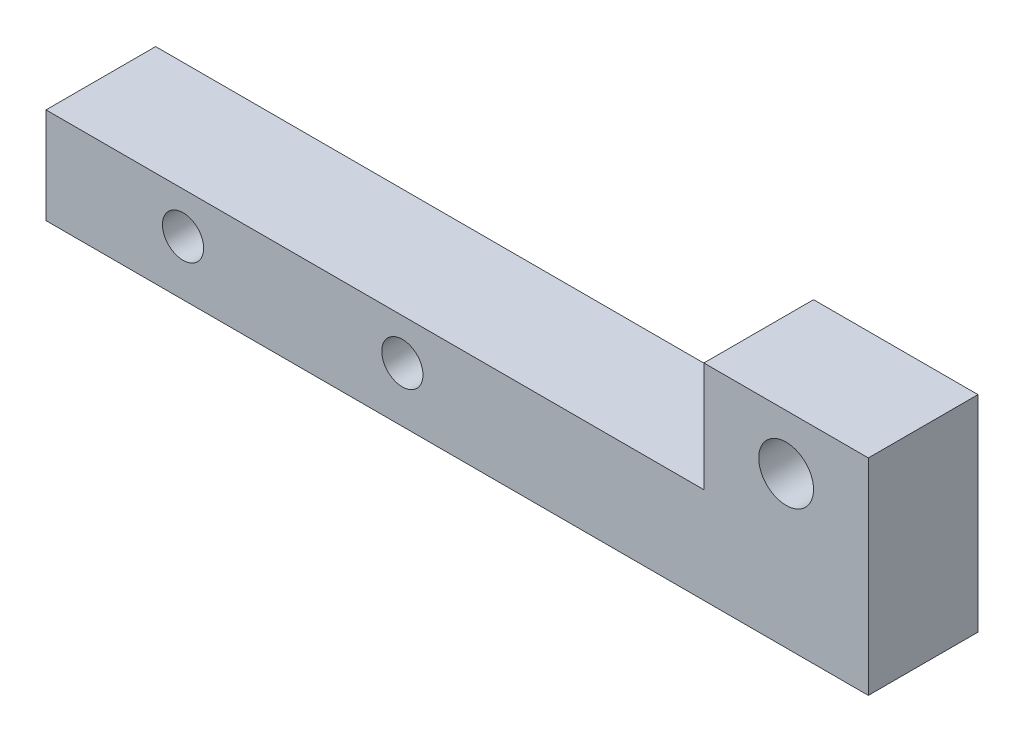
ISO-10303-21;
HEADER;
FILE_DESCRIPTION(('STEP AP214'),'2;1');
FILE_NAME('part.step','',(''),(''),'','','');
FILE_SCHEMA(('AUTOMOTIVE_DESIGN { 1 0 10303 214 1 1 1 1 }'));
ENDSEC;
DATA;
#1=APPLICATION_CONTEXT('core data for automotive mechanical design processes');
#2=APPLICATION_PROTOCOL_DEFINITION('international standard','automotive_design',2000,#1);
#3=PRODUCT_CONTEXT('',#1,'mechanical');
#4=PRODUCT('Part','Part','',(#3));
#5=PRODUCT_RELATED_PRODUCT_CATEGORY('part','',(#4));
#6=PRODUCT_DEFINITION_FORMATION('','',#4);
#7=PRODUCT_DEFINITION_CONTEXT('part definition',#1,'design');
#8=PRODUCT_DEFINITION('design','',#6,#7);
#9=PRODUCT_DEFINITION_SHAPE('','',#8);
#10=(LENGTH_UNIT() NAMED_UNIT(*) SI_UNIT(.MILLI.,.METRE.));
#11=(NAMED_UNIT(*) PLANE_ANGLE_UNIT() SI_UNIT($,.RADIAN.));
#12=(NAMED_UNIT(*) SI_UNIT($,.STERADIAN.) SOLID_ANGLE_UNIT());
#13=UNCERTAINTY_MEASURE_WITH_UNIT(LENGTH_MEASURE(1.E-05),#10,'distance_accuracy_value','');
#14=(GEOMETRIC_REPRESENTATION_CONTEXT(3) GLOBAL_UNCERTAINTY_ASSIGNED_CONTEXT((#13)) GLOBAL_UNIT_ASSIGNED_CONTEXT((#10,
#11,#12)) REPRESENTATION_CONTEXT('',''));
#15=CARTESIAN_POINT('',(0.,0.,0.));
#16=DIRECTION('',(0.,0.,1.));
#17=DIRECTION('',(1.,0.,0.));
#18=AXIS2_PLACEMENT_3D('',#15,#16,#17);
#19=CARTESIAN_POINT('',(0.,0.,12.7));
#20=DIRECTION('',(0.,0.,1.));
#21=DIRECTION('',(1.,0.,0.));
#22=AXIS2_PLACEMENT_3D('',#19,#20,#21);
#23=PLANE('',#22);
#24=CARTESIAN_POINT('',(0.,0.,12.7));
#25=DIRECTION('',(0.,0.,1.));
#26=DIRECTION('',(1.,0.,0.));
#27=AXIS2_PLACEMENT_3D('',#24,#25,#26);
#28=CIRCLE('',#27,2.3876);
#29=CARTESIAN_POINT('',(2.3876,0.,12.7));
#30=VERTEX_POINT('',#29);
#31=EDGE_CURVE('E160',#30,#30,#28,.T.);
#32=ORIENTED_EDGE('',*,*,#31,.F.);
#33=EDGE_LOOP('',(#32));
#34=FACE_BOUND('',#33,.T.);
#35=DIRECTION('',(0.,-1.,0.));
#36=VECTOR('',#35,1.);
#37=CARTESIAN_POINT('',(-15.875,4.76249999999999,12.7));
#38=LINE('',#37,#36);
#39=CARTESIAN_POINT('',(-15.875,4.76249999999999,12.7));
#40=VERTEX_POINT('',#39);
#41=CARTESIAN_POINT('',(-15.875,-6.35,12.7));
#42=VERTEX_POINT('',#41);
#43=EDGE_CURVE('E131',#40,#42,#38,.T.);
#44=ORIENTED_EDGE('',*,*,#43,.T.);
#45=DIRECTION('',(1.,0.,0.));
#46=VECTOR('',#45,1.);
#47=CARTESIAN_POINT('',(-15.875,-6.35,12.7));
#48=LINE('',#47,#46);
#49=CARTESIAN_POINT('',(79.375,-6.35,12.7));
#50=VERTEX_POINT('',#49);
#51=EDGE_CURVE('E89',#42,#50,#48,.T.);
#52=ORIENTED_EDGE('',*,*,#51,.T.);
#53=DIRECTION('',(0.,1.,0.));
#54=VECTOR('',#53,1.);
#55=CARTESIAN_POINT('',(79.375,-6.35,12.7));
#56=LINE('',#55,#54);
#57=CARTESIAN_POINT('',(79.375,17.4752,12.7));
#58=VERTEX_POINT('',#57);
#59=EDGE_CURVE('E102',#50,#58,#56,.T.);
#60=ORIENTED_EDGE('',*,*,#59,.T.);
#61=DIRECTION('',(-1.,0.,0.));
#62=VECTOR('',#61,1.);
#63=CARTESIAN_POINT('',(79.375,17.4752,12.7));
#64=LINE('',#63,#62);
#65=CARTESIAN_POINT('',(60.325,17.4752,12.7));
#66=VERTEX_POINT('',#65);
#67=EDGE_CURVE('E96',#58,#66,#64,.T.);
#68=ORIENTED_EDGE('',*,*,#67,.T.);
#69=DIRECTION('',(0.,-1.,0.));
#70=VECTOR('',#69,1.);
#71=CARTESIAN_POINT('',(60.325,17.4752,12.7));
#72=LINE('',#71,#70);
#73=CARTESIAN_POINT('',(60.325,4.7625,12.7));
#74=VERTEX_POINT('',#73);
#75=EDGE_CURVE('E100',#66,#74,#72,.T.);
#76=ORIENTED_EDGE('',*,*,#75,.T.);
#77=DIRECTION('',(-1.,0.,0.));
#78=VECTOR('',#77,1.);
#79=CARTESIAN_POINT('',(60.325,4.7625,12.7));
#80=LINE('',#79,#78);
#81=EDGE_CURVE('E52',#74,#40,#80,.T.);
#82=ORIENTED_EDGE('',*,*,#81,.T.);
#83=EDGE_LOOP('',(#44,#52,#60,#68,#76,#82));
#84=FACE_BOUND('',#83,.T.);
#85=CARTESIAN_POINT('',(25.4,0.,12.7));
#86=DIRECTION('',(0.,0.,1.));
#87=DIRECTION('',(1.,0.,0.));
#88=AXIS2_PLACEMENT_3D('',#85,#86,#87);
#89=CIRCLE('',#88,2.38760000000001);
#90=CARTESIAN_POINT('',(27.7876,0.,12.7));
#91=VERTEX_POINT('',#90);
#92=EDGE_CURVE('E124',#91,#91,#89,.T.);
#93=ORIENTED_EDGE('',*,*,#92,.F.);
#94=EDGE_LOOP('',(#93));
#95=FACE_BOUND('',#94,.T.);
#96=CARTESIAN_POINT('',(69.85,11.1252,12.7));
#97=DIRECTION('',(0.,0.,1.));
#98=DIRECTION('',(1.,0.,0.));
#99=AXIS2_PLACEMENT_3D('',#96,#97,#98);
#100=CIRCLE('',#99,3.175);
#101=CARTESIAN_POINT('',(73.025,11.1252,12.7));
#102=VERTEX_POINT('',#101);
#103=EDGE_CURVE('E157',#102,#102,#100,.T.);
#104=ORIENTED_EDGE('',*,*,#103,.F.);
#105=EDGE_LOOP('',(#104));
#106=FACE_BOUND('',#105,.T.);
#107=ADVANCED_FACE('F33',(#34,#84,#95,#106),#23,.T.);
#108=CARTESIAN_POINT('',(0.,0.,0.));
#109=DIRECTION('',(0.,0.,1.));
#110=DIRECTION('',(1.,0.,0.));
#111=AXIS2_PLACEMENT_3D('',#108,#109,#110);
#112=PLANE('',#111);
#113=CARTESIAN_POINT('',(25.4,0.,0.));
#114=DIRECTION('',(0.,0.,1.));
#115=DIRECTION('',(1.,0.,0.));
#116=AXIS2_PLACEMENT_3D('',#113,#114,#115);
#117=CIRCLE('',#116,3.9624);
#118=CARTESIAN_POINT('',(29.3624,0.,0.));
#119=VERTEX_POINT('',#118);
#120=EDGE_CURVE('E37',#119,#119,#117,.T.);
#121=ORIENTED_EDGE('',*,*,#120,.T.);
#122=EDGE_LOOP('',(#121));
#123=FACE_BOUND('',#122,.T.);
#124=CARTESIAN_POINT('',(0.,0.,0.));
#125=DIRECTION('',(0.,0.,1.));
#126=DIRECTION('',(1.,0.,0.));
#127=AXIS2_PLACEMENT_3D('',#124,#125,#126);
#128=CIRCLE('',#127,3.9624);
#129=CARTESIAN_POINT('',(3.9624,0.,0.));
#130=VERTEX_POINT('',#129);
#131=EDGE_CURVE('E140',#130,#130,#128,.T.);
#132=ORIENTED_EDGE('',*,*,#131,.T.);
#133=EDGE_LOOP('',(#132));
#134=FACE_BOUND('',#133,.T.);
#135=DIRECTION('',(0.,-1.,0.));
#136=VECTOR('',#135,1.);
#137=CARTESIAN_POINT('',(-15.875,4.76249999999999,0.));
#138=LINE('',#137,#136);
#139=CARTESIAN_POINT('',(-15.875,4.76249999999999,0.));
#140=VERTEX_POINT('',#139);
#141=CARTESIAN_POINT('',(-15.875,-6.35,0.));
#142=VERTEX_POINT('',#141);
#143=EDGE_CURVE('E120',#140,#142,#138,.T.);
#144=ORIENTED_EDGE('',*,*,#143,.F.);
#145=DIRECTION('',(-1.,0.,0.));
#146=VECTOR('',#145,1.);
#147=CARTESIAN_POINT('',(60.325,4.7625,0.));
#148=LINE('',#147,#146);
#149=CARTESIAN_POINT('',(60.325,4.7625,0.));
#150=VERTEX_POINT('',#149);
#151=EDGE_CURVE('E81',#150,#140,#148,.T.);
#152=ORIENTED_EDGE('',*,*,#151,.F.);
#153=DIRECTION('',(0.,-1.,0.));
#154=VECTOR('',#153,1.);
#155=CARTESIAN_POINT('',(60.325,17.4752,0.));
#156=LINE('',#155,#154);
#157=CARTESIAN_POINT('',(60.325,17.4752,0.));
#158=VERTEX_POINT('',#157);
#159=EDGE_CURVE('E75',#158,#150,#156,.T.);
#160=ORIENTED_EDGE('',*,*,#159,.F.);
#161=DIRECTION('',(-1.,0.,0.));
#162=VECTOR('',#161,1.);
#163=CARTESIAN_POINT('',(79.375,17.4752,0.));
#164=LINE('',#163,#162);
#165=CARTESIAN_POINT('',(79.375,17.4752,0.));
#166=VERTEX_POINT('',#165);
#167=EDGE_CURVE('E110',#166,#158,#164,.T.);
#168=ORIENTED_EDGE('',*,*,#167,.F.);
#169=DIRECTION('',(0.,1.,0.));
#170=VECTOR('',#169,1.);
#171=CARTESIAN_POINT('',(79.375,-6.35,0.));
#172=LINE('',#171,#170);
#173=CARTESIAN_POINT('',(79.375,-6.35,0.));
#174=VERTEX_POINT('',#173);
#175=EDGE_CURVE('E126',#174,#166,#172,.T.);
#176=ORIENTED_EDGE('',*,*,#175,.F.);
#177=DIRECTION('',(1.,0.,0.));
#178=VECTOR('',#177,1.);
#179=CARTESIAN_POINT('',(-15.875,-6.35,0.));
#180=LINE('',#179,#178);
#181=EDGE_CURVE('E123',#142,#174,#180,.T.);
#182=ORIENTED_EDGE('',*,*,#181,.F.);
#183=EDGE_LOOP('',(#144,#152,#160,#168,#176,#182));
#184=FACE_BOUND('',#183,.T.);
#185=CARTESIAN_POINT('',(69.85,11.1252,0.));
#186=DIRECTION('',(0.,0.,1.));
#187=DIRECTION('',(1.,0.,0.));
#188=AXIS2_PLACEMENT_3D('',#185,#186,#187);
#189=CIRCLE('',#188,3.175);
#190=CARTESIAN_POINT('',(73.025,11.1252,0.));
#191=VERTEX_POINT('',#190);
#192=EDGE_CURVE('E143',#191,#191,#189,.T.);
#193=ORIENTED_EDGE('',*,*,#192,.T.);
#194=EDGE_LOOP('',(#193));
#195=FACE_BOUND('',#194,.T.);
#196=ADVANCED_FACE('F176',(#123,#134,#184,#195),#112,.F.);
#197=CARTESIAN_POINT('',(-15.875,4.76249999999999,12.7));
#198=DIRECTION('',(1.,0.,0.));
#199=DIRECTION('',(0.,0.,-1.));
#200=AXIS2_PLACEMENT_3D('',#197,#198,#199);
#201=PLANE('',#200);
#202=ORIENTED_EDGE('',*,*,#143,.T.);
#203=DIRECTION('',(0.,0.,-1.));
#204=VECTOR('',#203,1.);
#205=CARTESIAN_POINT('',(-15.875,-6.35,12.7));
#206=LINE('',#205,#204);
#207=EDGE_CURVE('E11',#42,#142,#206,.T.);
#208=ORIENTED_EDGE('',*,*,#207,.F.);
#209=ORIENTED_EDGE('',*,*,#43,.F.);
#210=DIRECTION('',(0.,0.,-1.));
#211=VECTOR('',#210,1.);
#212=CARTESIAN_POINT('',(-15.875,4.76249999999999,12.7));
#213=LINE('',#212,#211);
#214=EDGE_CURVE('E116',#40,#140,#213,.T.);
#215=ORIENTED_EDGE('',*,*,#214,.T.);
#216=EDGE_LOOP('',(#202,#208,#209,#215));
#217=FACE_BOUND('',#216,.T.);
#218=ADVANCED_FACE('F35',(#217),#201,.F.);
#219=CARTESIAN_POINT('',(-15.875,-6.35,12.7));
#220=DIRECTION('',(0.,1.,0.));
#221=DIRECTION('',(-1.,0.,0.));
#222=AXIS2_PLACEMENT_3D('',#219,#220,#221);
#223=PLANE('',#222);
#224=ORIENTED_EDGE('',*,*,#181,.T.);
#225=DIRECTION('',(0.,0.,-1.));
#226=VECTOR('',#225,1.);
#227=CARTESIAN_POINT('',(79.375,-6.35,12.7));
#228=LINE('',#227,#226);
#229=EDGE_CURVE('E43',#50,#174,#228,.T.);
#230=ORIENTED_EDGE('',*,*,#229,.F.);
#231=ORIENTED_EDGE('',*,*,#51,.F.);
#232=ORIENTED_EDGE('',*,*,#207,.T.);
#233=EDGE_LOOP('',(#224,#230,#231,#232));
#234=FACE_BOUND('',#233,.T.);
#235=ADVANCED_FACE('F170',(#234),#223,.F.);
#236=CARTESIAN_POINT('',(79.375,-6.35,12.7));
#237=DIRECTION('',(-1.,0.,0.));
#238=DIRECTION('',(0.,-1.,0.));
#239=AXIS2_PLACEMENT_3D('',#236,#237,#238);
#240=PLANE('',#239);
#241=ORIENTED_EDGE('',*,*,#175,.T.);
#242=DIRECTION('',(0.,0.,-1.));
#243=VECTOR('',#242,1.);
#244=CARTESIAN_POINT('',(79.375,17.4752,12.7));
#245=LINE('',#244,#243);
#246=EDGE_CURVE('E111',#58,#166,#245,.T.);
#247=ORIENTED_EDGE('',*,*,#246,.F.);
#248=ORIENTED_EDGE('',*,*,#59,.F.);
#249=ORIENTED_EDGE('',*,*,#229,.T.);
#250=EDGE_LOOP('',(#241,#247,#248,#249));
#251=FACE_BOUND('',#250,.T.);
#252=ADVANCED_FACE('F173',(#251),#240,.F.);
#253=CARTESIAN_POINT('',(79.375,17.4752,12.7));
#254=DIRECTION('',(0.,-1.,0.));
#255=DIRECTION('',(0.,0.,-1.));
#256=AXIS2_PLACEMENT_3D('',#253,#254,#255);
#257=PLANE('',#256);
#258=ORIENTED_EDGE('',*,*,#167,.T.);
#259=DIRECTION('',(0.,0.,-1.));
#260=VECTOR('',#259,1.);
#261=CARTESIAN_POINT('',(60.325,17.4752,12.7));
#262=LINE('',#261,#260);
#263=EDGE_CURVE('E107',#66,#158,#262,.T.);
#264=ORIENTED_EDGE('',*,*,#263,.F.);
#265=ORIENTED_EDGE('',*,*,#67,.F.);
#266=ORIENTED_EDGE('',*,*,#246,.T.);
#267=EDGE_LOOP('',(#258,#264,#265,#266));
#268=FACE_BOUND('',#267,.T.);
#269=ADVANCED_FACE('F108',(#268),#257,.F.);
#270=CARTESIAN_POINT('',(60.325,17.4752,12.7));
#271=DIRECTION('',(1.,0.,0.));
#272=DIRECTION('',(0.,0.,-1.));
#273=AXIS2_PLACEMENT_3D('',#270,#271,#272);
#274=PLANE('',#273);
#275=ORIENTED_EDGE('',*,*,#159,.T.);
#276=DIRECTION('',(0.,0.,-1.));
#277=VECTOR('',#276,1.);
#278=CARTESIAN_POINT('',(60.325,4.7625,12.7));
#279=LINE('',#278,#277);
#280=EDGE_CURVE('E112',#74,#150,#279,.T.);
#281=ORIENTED_EDGE('',*,*,#280,.F.);
#282=ORIENTED_EDGE('',*,*,#75,.F.);
#283=ORIENTED_EDGE('',*,*,#263,.T.);
#284=EDGE_LOOP('',(#275,#281,#282,#283));
#285=FACE_BOUND('',#284,.T.);
#286=ADVANCED_FACE('F114',(#285),#274,.F.);
#287=CARTESIAN_POINT('',(60.325,4.7625,12.7));
#288=DIRECTION('',(0.,-1.,0.));
#289=DIRECTION('',(1.,0.,0.));
#290=AXIS2_PLACEMENT_3D('',#287,#288,#289);
#291=PLANE('',#290);
#292=ORIENTED_EDGE('',*,*,#151,.T.);
#293=ORIENTED_EDGE('',*,*,#214,.F.);
#294=ORIENTED_EDGE('',*,*,#81,.F.);
#295=ORIENTED_EDGE('',*,*,#280,.T.);
#296=EDGE_LOOP('',(#292,#293,#294,#295));
#297=FACE_BOUND('',#296,.T.);
#298=ADVANCED_FACE('F179',(#297),#291,.F.);
#299=CARTESIAN_POINT('',(25.4,0.,12.7));
#300=DIRECTION('',(0.,0.,-1.));
#301=DIRECTION('',(-1.,0.,0.));
#302=AXIS2_PLACEMENT_3D('',#299,#300,#301);
#303=CYLINDRICAL_SURFACE('',#302,2.38760000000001);
#304=CARTESIAN_POINT('',(25.4,0.,4.7752));
#305=DIRECTION('',(0.,0.,1.));
#306=DIRECTION('',(1.,0.,0.));
#307=AXIS2_PLACEMENT_3D('',#304,#305,#306);
#308=CIRCLE('',#307,2.38760000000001);
#309=CARTESIAN_POINT('',(27.7876,0.,4.7752));
#310=VERTEX_POINT('',#309);
#311=EDGE_CURVE('E144',#310,#310,#308,.T.);
#312=ORIENTED_EDGE('',*,*,#311,.F.);
#313=EDGE_LOOP('',(#312));
#314=FACE_BOUND('',#313,.T.);
#315=ORIENTED_EDGE('',*,*,#92,.T.);
#316=EDGE_LOOP('',(#315));
#317=FACE_BOUND('',#316,.T.);
#318=ADVANCED_FACE('F181',(#314,#317),#303,.F.);
#319=CARTESIAN_POINT('',(0.,0.,12.7));
#320=DIRECTION('',(0.,0.,-1.));
#321=DIRECTION('',(-1.,0.,0.));
#322=AXIS2_PLACEMENT_3D('',#319,#320,#321);
#323=CYLINDRICAL_SURFACE('',#322,2.3876);
#324=CARTESIAN_POINT('',(0.,0.,4.7752));
#325=DIRECTION('',(0.,0.,1.));
#326=DIRECTION('',(1.,0.,0.));
#327=AXIS2_PLACEMENT_3D('',#324,#325,#326);
#328=CIRCLE('',#327,2.3876);
#329=CARTESIAN_POINT('',(2.3876,0.,4.7752));
#330=VERTEX_POINT('',#329);
#331=EDGE_CURVE('E137',#330,#330,#328,.T.);
#332=ORIENTED_EDGE('',*,*,#331,.F.);
#333=EDGE_LOOP('',(#332));
#334=FACE_BOUND('',#333,.T.);
#335=ORIENTED_EDGE('',*,*,#31,.T.);
#336=EDGE_LOOP('',(#335));
#337=FACE_BOUND('',#336,.T.);
#338=ADVANCED_FACE('F187',(#334,#337),#323,.F.);
#339=CARTESIAN_POINT('',(69.85,11.1252,12.7));
#340=DIRECTION('',(0.,0.,-1.));
#341=DIRECTION('',(-1.,0.,0.));
#342=AXIS2_PLACEMENT_3D('',#339,#340,#341);
#343=CYLINDRICAL_SURFACE('',#342,3.175);
#344=ORIENTED_EDGE('',*,*,#103,.T.);
#345=EDGE_LOOP('',(#344));
#346=FACE_BOUND('',#345,.T.);
#347=ORIENTED_EDGE('',*,*,#192,.F.);
#348=EDGE_LOOP('',(#347));
#349=FACE_BOUND('',#348,.T.);
#350=ADVANCED_FACE('F203',(#346,#349),#343,.F.);
#351=CARTESIAN_POINT('',(0.,0.,-4.7498));
#352=DIRECTION('',(0.,0.,1.));
#353=DIRECTION('',(1.,0.,0.));
#354=AXIS2_PLACEMENT_3D('',#351,#352,#353);
#355=CYLINDRICAL_SURFACE('',#354,3.9624);
#356=CARTESIAN_POINT('',(0.,0.,4.7752));
#357=DIRECTION('',(0.,0.,1.));
#358=DIRECTION('',(1.,0.,0.));
#359=AXIS2_PLACEMENT_3D('',#356,#357,#358);
#360=CIRCLE('',#359,3.9624);
#361=CARTESIAN_POINT('',(3.9624,0.,4.7752));
#362=VERTEX_POINT('',#361);
#363=EDGE_CURVE('E141',#362,#362,#360,.T.);
#364=CARTESIAN_POINT('',(3.9624,0.,4.7752));
#365=CARTESIAN_POINT('',(3.9624,0.,4.72545833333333));
#366=CARTESIAN_POINT('',(3.9624,0.,4.67571666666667));
#367=CARTESIAN_POINT('',(3.9624,0.,4.57623333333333));
#368=CARTESIAN_POINT('',(3.9624,0.,4.52649166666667));
#369=CARTESIAN_POINT('',(3.9624,0.,4.42700833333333));
#370=CARTESIAN_POINT('',(3.9624,0.,4.37726666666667));
#371=CARTESIAN_POINT('',(3.9624,0.,4.27778333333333));
#372=CARTESIAN_POINT('',(3.9624,0.,4.22804166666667));
#373=CARTESIAN_POINT('',(3.9624,0.,4.12855833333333));
#374=CARTESIAN_POINT('',(3.9624,0.,4.07881666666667));
#375=CARTESIAN_POINT('',(3.9624,0.,3.97933333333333));
#376=CARTESIAN_POINT('',(3.9624,0.,3.92959166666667));
#377=CARTESIAN_POINT('',(3.9624,0.,3.83010833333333));
#378=CARTESIAN_POINT('',(3.9624,0.,3.78036666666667));
#379=CARTESIAN_POINT('',(3.9624,0.,3.68088333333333));
#380=CARTESIAN_POINT('',(3.9624,0.,3.63114166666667));
#381=CARTESIAN_POINT('',(3.9624,0.,3.53165833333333));
#382=CARTESIAN_POINT('',(3.9624,0.,3.48191666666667));
#383=CARTESIAN_POINT('',(3.9624,0.,3.38243333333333));
#384=CARTESIAN_POINT('',(3.9624,0.,3.33269166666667));
#385=CARTESIAN_POINT('',(3.9624,0.,3.23320833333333));
#386=CARTESIAN_POINT('',(3.9624,0.,3.18346666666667));
#387=CARTESIAN_POINT('',(3.9624,0.,3.08398333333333));
#388=CARTESIAN_POINT('',(3.9624,0.,3.03424166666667));
#389=CARTESIAN_POINT('',(3.9624,0.,2.93475833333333));
#390=CARTESIAN_POINT('',(3.9624,0.,2.88501666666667));
#391=CARTESIAN_POINT('',(3.9624,0.,2.78553333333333));
#392=CARTESIAN_POINT('',(3.9624,0.,2.73579166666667));
#393=CARTESIAN_POINT('',(3.9624,0.,2.63630833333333));
#394=CARTESIAN_POINT('',(3.9624,0.,2.58656666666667));
#395=CARTESIAN_POINT('',(3.9624,0.,2.48708333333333));
#396=CARTESIAN_POINT('',(3.9624,0.,2.43734166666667));
#397=CARTESIAN_POINT('',(3.9624,0.,2.33785833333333));
#398=CARTESIAN_POINT('',(3.9624,0.,2.28811666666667));
#399=CARTESIAN_POINT('',(3.9624,0.,2.18863333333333));
#400=CARTESIAN_POINT('',(3.9624,0.,2.13889166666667));
#401=CARTESIAN_POINT('',(3.9624,0.,2.03940833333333));
#402=CARTESIAN_POINT('',(3.9624,0.,1.98966666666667));
#403=CARTESIAN_POINT('',(3.9624,0.,1.89018333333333));
#404=CARTESIAN_POINT('',(3.9624,0.,1.84044166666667));
#405=CARTESIAN_POINT('',(3.9624,0.,1.74095833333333));
#406=CARTESIAN_POINT('',(3.9624,0.,1.69121666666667));
#407=CARTESIAN_POINT('',(3.9624,0.,1.59173333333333));
#408=CARTESIAN_POINT('',(3.9624,0.,1.54199166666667));
#409=CARTESIAN_POINT('',(3.9624,0.,1.44250833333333));
#410=CARTESIAN_POINT('',(3.9624,0.,1.39276666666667));
#411=CARTESIAN_POINT('',(3.9624,0.,1.29328333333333));
#412=CARTESIAN_POINT('',(3.9624,0.,1.24354166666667));
#413=CARTESIAN_POINT('',(3.9624,0.,1.14405833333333));
#414=CARTESIAN_POINT('',(3.9624,0.,1.09431666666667));
#415=CARTESIAN_POINT('',(3.9624,0.,0.994833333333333));
#416=CARTESIAN_POINT('',(3.9624,0.,0.945091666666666));
#417=CARTESIAN_POINT('',(3.9624,0.,0.845608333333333));
#418=CARTESIAN_POINT('',(3.9624,0.,0.795866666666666));
#419=CARTESIAN_POINT('',(3.9624,0.,0.696383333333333));
#420=CARTESIAN_POINT('',(3.9624,0.,0.646641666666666));
#421=CARTESIAN_POINT('',(3.9624,0.,0.547158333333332));
#422=CARTESIAN_POINT('',(3.9624,0.,0.497416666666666));
#423=CARTESIAN_POINT('',(3.9624,0.,0.397933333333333));
#424=CARTESIAN_POINT('',(3.9624,0.,0.348191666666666));
#425=CARTESIAN_POINT('',(3.9624,0.,0.248708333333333));
#426=CARTESIAN_POINT('',(3.9624,0.,0.198966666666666));
#427=CARTESIAN_POINT('',(3.9624,0.,0.0994833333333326));
#428=CARTESIAN_POINT('',(3.9624,0.,0.0497416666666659));
#429=CARTESIAN_POINT('',(3.9624,0.,0.));
#430=B_SPLINE_CURVE_WITH_KNOTS('',3,(#364,#365,#366,#367,#368,#369,#370,#371,#372,#373,#374,
#375,#376,#377,#378,#379,#380,#381,#382,#383,#384,#385,#386,#387,#388,#389,#390,#391,#392,#393,
#394,#395,#396,#397,#398,#399,#400,#401,#402,#403,#404,#405,#406,#407,#408,#409,#410,#411,#412,
#413,#414,#415,#416,#417,#418,#419,#420,#421,#422,#423,#424,#425,#426,#427,#428,#429),
.UNSPECIFIED.,.F.,.F.,(4,2,2,2,2,2,2,2,2,2,2,2,2,2,2,2,2,2,2,2,2,2,2,2,2,2,2,2,2,2,2,2,4),(0.,
0.149224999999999,0.29845,0.447675,0.596900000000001,0.746125,0.89535,1.044575,1.1938,1.343025,
1.49225,1.641475,1.7907,1.939925,2.08915,2.238375,2.3876,2.536825,2.68605,2.835275,2.9845,
3.133725,3.28295,3.432175,3.5814,3.730625,3.87985,4.029075,4.1783,4.327525,4.47675,4.625975,
4.7752),.UNSPECIFIED.);
#431=EDGE_CURVE('BSEAM207',#362,#130,#430,.T.);
#432=ORIENTED_EDGE('',*,*,#363,.T.);
#433=ORIENTED_EDGE('',*,*,#131,.F.);
#434=ORIENTED_EDGE('',*,*,#431,.T.);
#435=ORIENTED_EDGE('',*,*,#431,.F.);
#436=EDGE_LOOP('',(#432,#434,#433,#435));
#437=FACE_BOUND('',#436,.T.);
#438=ADVANCED_FACE('F207',(#437),#355,.F.);
#439=CARTESIAN_POINT('',(0.,0.,4.7752));
#440=DIRECTION('',(0.,0.,1.));
#441=DIRECTION('',(1.,0.,0.));
#442=AXIS2_PLACEMENT_3D('',#439,#440,#441);
#443=PLANE('',#442);
#444=ORIENTED_EDGE('',*,*,#331,.T.);
#445=EDGE_LOOP('',(#444));
#446=FACE_BOUND('',#445,.T.);
#447=ORIENTED_EDGE('',*,*,#363,.F.);
#448=EDGE_LOOP('',(#447));
#449=FACE_BOUND('',#448,.T.);
#450=ADVANCED_FACE('F211',(#446,#449),#443,.F.);
#451=CARTESIAN_POINT('',(25.4,0.,-4.7498));
#452=DIRECTION('',(0.,0.,1.));
#453=DIRECTION('',(1.,0.,0.));
#454=AXIS2_PLACEMENT_3D('',#451,#452,#453);
#455=CYLINDRICAL_SURFACE('',#454,3.9624);
#456=CARTESIAN_POINT('',(25.4,0.,4.7752));
#457=DIRECTION('',(0.,0.,1.));
#458=DIRECTION('',(1.,0.,0.));
#459=AXIS2_PLACEMENT_3D('',#456,#457,#458);
#460=CIRCLE('',#459,3.9624);
#461=CARTESIAN_POINT('',(29.3624,0.,4.7752));
#462=VERTEX_POINT('',#461);
#463=EDGE_CURVE('E146',#462,#462,#460,.T.);
#464=CARTESIAN_POINT('',(29.3624,0.,4.7752));
#465=CARTESIAN_POINT('',(29.3624,0.,4.72545833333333));
#466=CARTESIAN_POINT('',(29.3624,0.,4.67571666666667));
#467=CARTESIAN_POINT('',(29.3624,0.,4.57623333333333));
#468=CARTESIAN_POINT('',(29.3624,0.,4.52649166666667));
#469=CARTESIAN_POINT('',(29.3624,0.,4.42700833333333));
#470=CARTESIAN_POINT('',(29.3624,0.,4.37726666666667));
#471=CARTESIAN_POINT('',(29.3624,0.,4.27778333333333));
#472=CARTESIAN_POINT('',(29.3624,0.,4.22804166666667));
#473=CARTESIAN_POINT('',(29.3624,0.,4.12855833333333));
#474=CARTESIAN_POINT('',(29.3624,0.,4.07881666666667));
#475=CARTESIAN_POINT('',(29.3624,0.,3.97933333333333));
#476=CARTESIAN_POINT('',(29.3624,0.,3.92959166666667));
#477=CARTESIAN_POINT('',(29.3624,0.,3.83010833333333));
#478=CARTESIAN_POINT('',(29.3624,0.,3.78036666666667));
#479=CARTESIAN_POINT('',(29.3624,0.,3.68088333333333));
#480=CARTESIAN_POINT('',(29.3624,0.,3.63114166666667));
#481=CARTESIAN_POINT('',(29.3624,0.,3.53165833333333));
#482=CARTESIAN_POINT('',(29.3624,0.,3.48191666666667));
#483=CARTESIAN_POINT('',(29.3624,0.,3.38243333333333));
#484=CARTESIAN_POINT('',(29.3624,0.,3.33269166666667));
#485=CARTESIAN_POINT('',(29.3624,0.,3.23320833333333));
#486=CARTESIAN_POINT('',(29.3624,0.,3.18346666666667));
#487=CARTESIAN_POINT('',(29.3624,0.,3.08398333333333));
#488=CARTESIAN_POINT('',(29.3624,0.,3.03424166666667));
#489=CARTESIAN_POINT('',(29.3624,0.,2.93475833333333));
#490=CARTESIAN_POINT('',(29.3624,0.,2.88501666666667));
#491=CARTESIAN_POINT('',(29.3624,0.,2.78553333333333));
#492=CARTESIAN_POINT('',(29.3624,0.,2.73579166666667));
#493=CARTESIAN_POINT('',(29.3624,0.,2.63630833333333));
#494=CARTESIAN_POINT('',(29.3624,0.,2.58656666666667));
#495=CARTESIAN_POINT('',(29.3624,0.,2.48708333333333));
#496=CARTESIAN_POINT('',(29.3624,0.,2.43734166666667));
#497=CARTESIAN_POINT('',(29.3624,0.,2.33785833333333));
#498=CARTESIAN_POINT('',(29.3624,0.,2.28811666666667));
#499=CARTESIAN_POINT('',(29.3624,0.,2.18863333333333));
#500=CARTESIAN_POINT('',(29.3624,0.,2.13889166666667));
#501=CARTESIAN_POINT('',(29.3624,0.,2.03940833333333));
#502=CARTESIAN_POINT('',(29.3624,0.,1.98966666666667));
#503=CARTESIAN_POINT('',(29.3624,0.,1.89018333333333));
#504=CARTESIAN_POINT('',(29.3624,0.,1.84044166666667));
#505=CARTESIAN_POINT('',(29.3624,0.,1.74095833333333));
#506=CARTESIAN_POINT('',(29.3624,0.,1.69121666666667));
#507=CARTESIAN_POINT('',(29.3624,0.,1.59173333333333));
#508=CARTESIAN_POINT('',(29.3624,0.,1.54199166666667));
#509=CARTESIAN_POINT('',(29.3624,0.,1.44250833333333));
#510=CARTESIAN_POINT('',(29.3624,0.,1.39276666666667));
#511=CARTESIAN_POINT('',(29.3624,0.,1.29328333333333));
#512=CARTESIAN_POINT('',(29.3624,0.,1.24354166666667));
#513=CARTESIAN_POINT('',(29.3624,0.,1.14405833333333));
#514=CARTESIAN_POINT('',(29.3624,0.,1.09431666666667));
#515=CARTESIAN_POINT('',(29.3624,0.,0.994833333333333));
#516=CARTESIAN_POINT('',(29.3624,0.,0.945091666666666));
#517=CARTESIAN_POINT('',(29.3624,0.,0.845608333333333));
#518=CARTESIAN_POINT('',(29.3624,0.,0.795866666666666));
#519=CARTESIAN_POINT('',(29.3624,0.,0.696383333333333));
#520=CARTESIAN_POINT('',(29.3624,0.,0.646641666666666));
#521=CARTESIAN_POINT('',(29.3624,0.,0.547158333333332));
#522=CARTESIAN_POINT('',(29.3624,0.,0.497416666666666));
#523=CARTESIAN_POINT('',(29.3624,0.,0.397933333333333));
#524=CARTESIAN_POINT('',(29.3624,0.,0.348191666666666));
#525=CARTESIAN_POINT('',(29.3624,0.,0.248708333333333));
#526=CARTESIAN_POINT('',(29.3624,0.,0.198966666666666));
#527=CARTESIAN_POINT('',(29.3624,0.,0.0994833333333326));
#528=CARTESIAN_POINT('',(29.3624,0.,0.0497416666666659));
#529=CARTESIAN_POINT('',(29.3624,0.,0.));
#530=B_SPLINE_CURVE_WITH_KNOTS('',3,(#464,#465,#466,#467,#468,#469,#470,#471,#472,#473,#474,
#475,#476,#477,#478,#479,#480,#481,#482,#483,#484,#485,#486,#487,#488,#489,#490,#491,#492,#493,
#494,#495,#496,#497,#498,#499,#500,#501,#502,#503,#504,#505,#506,#507,#508,#509,#510,#511,#512,
#513,#514,#515,#516,#517,#518,#519,#520,#521,#522,#523,#524,#525,#526,#527,#528,#529),
.UNSPECIFIED.,.F.,.F.,(4,2,2,2,2,2,2,2,2,2,2,2,2,2,2,2,2,2,2,2,2,2,2,2,2,2,2,2,2,2,2,2,4),(0.,
0.149224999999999,0.29845,0.447675,0.596900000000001,0.746125,0.89535,1.044575,1.1938,1.343025,
1.49225,1.641475,1.7907,1.939925,2.08915,2.238375,2.3876,2.536825,2.68605,2.835275,2.9845,
3.133725,3.28295,3.432175,3.5814,3.730625,3.87985,4.029075,4.1783,4.327525,4.47675,4.625975,
4.7752),.UNSPECIFIED.);
#531=EDGE_CURVE('BSEAM215',#462,#119,#530,.T.);
#532=ORIENTED_EDGE('',*,*,#463,.T.);
#533=ORIENTED_EDGE('',*,*,#120,.F.);
#534=ORIENTED_EDGE('',*,*,#531,.T.);
#535=ORIENTED_EDGE('',*,*,#531,.F.);
#536=EDGE_LOOP('',(#532,#534,#533,#535));
#537=FACE_BOUND('',#536,.T.);
#538=ADVANCED_FACE('F215',(#537),#455,.F.);
#539=CARTESIAN_POINT('',(25.4,0.,4.7752));
#540=DIRECTION('',(0.,0.,1.));
#541=DIRECTION('',(1.,0.,0.));
#542=AXIS2_PLACEMENT_3D('',#539,#540,#541);
#543=PLANE('',#542);
#544=ORIENTED_EDGE('',*,*,#311,.T.);
#545=EDGE_LOOP('',(#544));
#546=FACE_BOUND('',#545,.T.);
#547=ORIENTED_EDGE('',*,*,#463,.F.);
#548=EDGE_LOOP('',(#547));
#549=FACE_BOUND('',#548,.T.);
#550=ADVANCED_FACE('F219',(#546,#549),#543,.F.);
#551=CLOSED_SHELL('',(#107,#196,#218,#235,#252,#269,#286,#298,#318,#338,#350,#438,#450,#538,#550));
#552=MANIFOLD_SOLID_BREP('B2',#551);
#553=ADVANCED_BREP_SHAPE_REPRESENTATION('',(#18,#552),#14);
#554=SHAPE_DEFINITION_REPRESENTATION(#9,#553);
ENDSEC;
END-ISO-10303-21;
